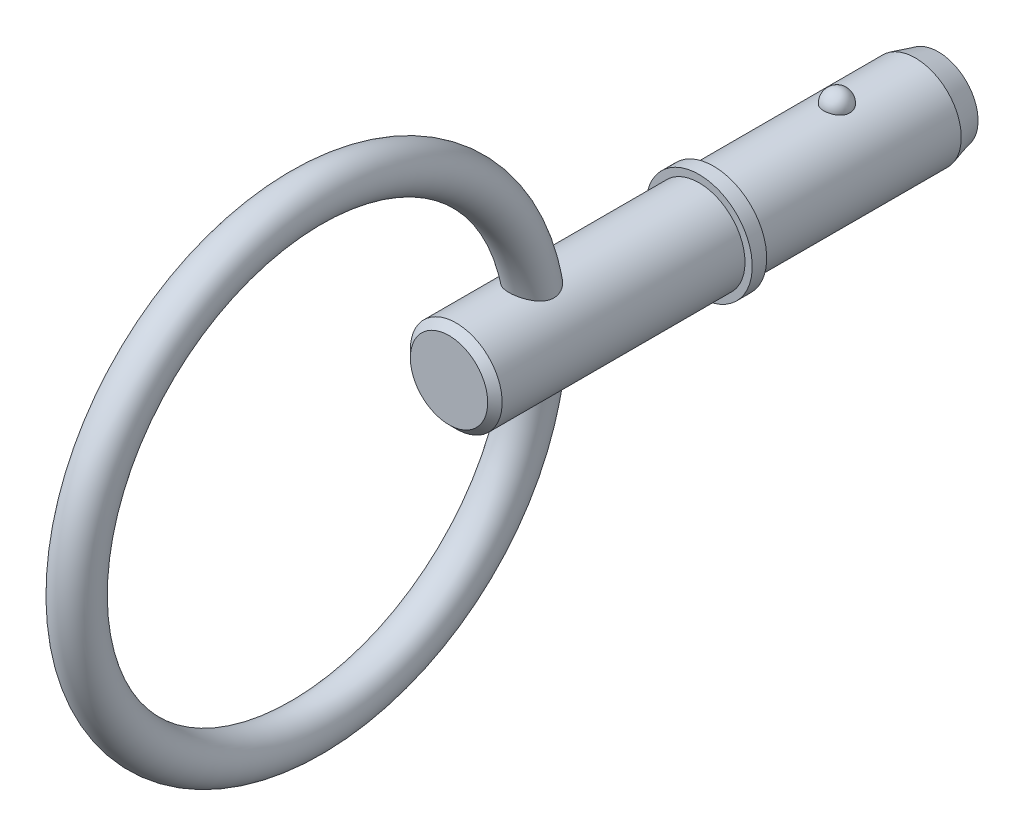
from build123d import *

# Parameters (mm, degrees)
SKETCH2_R           = 3.175
BOSS_EXTRUDE1_DEPTH = 7.62
BOSS_EXTRUDE2_START = 7.92
SKETCH3_R           = 3.175
BOSS_EXTRUDE2_DEPTH = 7.92
CHAMFER1_SIZE       = 1.586
CHAMFER1_SIZE2      = 0.424967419
SKETCH20_W          = 1
SKETCH20_H          = 3.675
SKETCH21_R          = 3.175
BOSS_EXTRUDE3_DEPTH = 18.29
CHAMFER2_SIZE       = 0.5
SKETCH24_R          = 1.5


with BuildPart() as part:
    # Sketch2 → Boss-Extrude1 (new body)
    with BuildSketch(Plane.XY):
        Circle(SKETCH2_R)
    extrude(amount=BOSS_EXTRUDE1_DEPTH)

    # Sketch3 → Boss-Extrude2 (add)
    with BuildSketch(Plane(origin=(0, 0, 0), x_dir=(-1, 0, 0), z_dir=(0, 0, -1)).offset(BOSS_EXTRUDE2_START)):
        Circle(SKETCH3_R)
    extrude(amount=-BOSS_EXTRUDE2_DEPTH)

    # Chamfer1
    chamfer1_edges = [part.edges().sort_by_distance(p)[0] for p in [
        (3.175, 0, -7.92),
    ]]
    chamfer1_side = [part.faces().sort_by_distance(p)[0] for p in [
        (3.175, 0, -3.96),
    ]]
    chamfer(chamfer1_edges, length=CHAMFER1_SIZE, length2=CHAMFER1_SIZE2, reference=chamfer1_side[0])

    # Sketch18 → Revolve1 (revolve)
    with BuildSketch(Plane(origin=(0, 0, 0), x_dir=(0, 0, -1), z_dir=(1, 0, 0))):
        with BuildLine():
            Line((0.91, 4.085), (0.91, 2.265))
            ThreePointArc((0.91, 2.265), (0, 3.175), (0.91, 4.085))
        make_face()
    revolve(axis=Axis((0, 4.085, -0.91), (0, -1, 0)))

    # Sketch20 → Revolve2 (revolve)
    with BuildSketch(Plane(origin=(0, 0, 0), x_dir=(0, 0, -1), z_dir=(1, 0, 0)), mode=Mode.PRIVATE) as revolve2_sk:
        with Locations((-8.12, 1.8375)):
            Rectangle(SKETCH20_W, SKETCH20_H)
    revolve(revolve2_sk.sketch.rotate(Axis((0, 0, 33.728787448), (0, 0, 1)), 90), axis=Axis((0, 0, 33.728787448), (0, 0, 1)))

    # Sketch21 → Boss-Extrude3 (add)
    with BuildSketch(Plane(origin=(0, 0, 7.62), x_dir=(-1, 0, 0), z_dir=(0, 0, -1))):
        Circle(SKETCH21_R)
    extrude(amount=-BOSS_EXTRUDE3_DEPTH)

    # Chamfer2
    chamfer2_edges = [part.edges().sort_by_distance(p)[0] for p in [
        (3.175, 0, 25.91),
    ]]
    chamfer(chamfer2_edges, length=CHAMFER2_SIZE)

    # Sweep1: sweep along a path in Sketch23
    with BuildLine(Plane(origin=(0, 0, 0), x_dir=(0, 0, -1), z_dir=(1, 0, 0))) as sweep1_path:
        CenterArc((-35.785, 0), 15.875, 0, 360)
    # Sketch24 → Sweep1 (sweep)
    with BuildSketch(Plane(origin=(0, 0, 0), x_dir=(1, 0, 0), z_dir=(0, 1, 0))):
        with Locations((0, -19.91)):
            Circle(SKETCH24_R)
    sweep(path=sweep1_path.line)


solid = part.part
